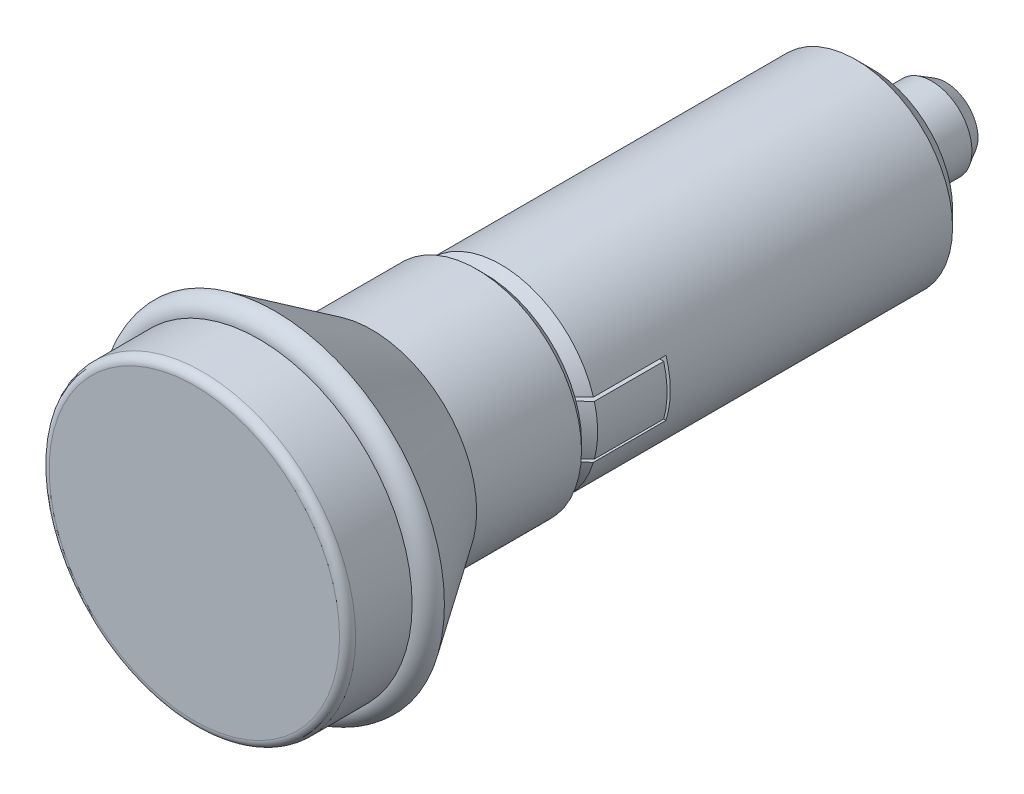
ISO-10303-21;
HEADER;
FILE_DESCRIPTION(('STEP AP214'),'2;1');
FILE_NAME('part.step','',(''),(''),'','','');
FILE_SCHEMA(('AUTOMOTIVE_DESIGN { 1 0 10303 214 1 1 1 1 }'));
ENDSEC;
DATA;
#1=APPLICATION_CONTEXT('core data for automotive mechanical design processes');
#2=APPLICATION_PROTOCOL_DEFINITION('international standard','automotive_design',2000,#1);
#3=PRODUCT_CONTEXT('',#1,'mechanical');
#4=PRODUCT('Part','Part','',(#3));
#5=PRODUCT_RELATED_PRODUCT_CATEGORY('part','',(#4));
#6=PRODUCT_DEFINITION_FORMATION('','',#4);
#7=PRODUCT_DEFINITION_CONTEXT('part definition',#1,'design');
#8=PRODUCT_DEFINITION('design','',#6,#7);
#9=PRODUCT_DEFINITION_SHAPE('','',#8);
#10=(LENGTH_UNIT() NAMED_UNIT(*) SI_UNIT(.MILLI.,.METRE.));
#11=(NAMED_UNIT(*) PLANE_ANGLE_UNIT() SI_UNIT($,.RADIAN.));
#12=(NAMED_UNIT(*) SI_UNIT($,.STERADIAN.) SOLID_ANGLE_UNIT());
#13=UNCERTAINTY_MEASURE_WITH_UNIT(LENGTH_MEASURE(1.E-05),#10,'distance_accuracy_value','');
#14=(GEOMETRIC_REPRESENTATION_CONTEXT(3) GLOBAL_UNCERTAINTY_ASSIGNED_CONTEXT((#13)) GLOBAL_UNIT_ASSIGNED_CONTEXT((#10,
#11,#12)) REPRESENTATION_CONTEXT('',''));
#15=CARTESIAN_POINT('',(0.,0.,0.));
#16=DIRECTION('',(0.,0.,1.));
#17=DIRECTION('',(1.,0.,0.));
#18=AXIS2_PLACEMENT_3D('',#15,#16,#17);
#19=CARTESIAN_POINT('',(0.,0.,24.));
#20=DIRECTION('',(0.,0.,-1.));
#21=DIRECTION('',(-1.,0.,0.));
#22=AXIS2_PLACEMENT_3D('',#19,#20,#21);
#23=CONICAL_SURFACE('',#22,5.,0.785398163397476);
#24=CARTESIAN_POINT('',(0.,0.,23.));
#25=DIRECTION('',(0.,0.,1.));
#26=DIRECTION('',(1.,0.,0.));
#27=AXIS2_PLACEMENT_3D('',#24,#25,#26);
#28=CIRCLE('',#27,6.);
#29=CARTESIAN_POINT('',(-5.7391201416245,-1.75,23.));
#30=VERTEX_POINT('',#29);
#31=CARTESIAN_POINT('',(5.7391201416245,-1.75,23.));
#32=VERTEX_POINT('',#31);
#33=EDGE_CURVE('E274',#30,#32,#28,.T.);
#34=ORIENTED_EDGE('',*,*,#33,.T.);
#35=CARTESIAN_POINT('',(9.98606413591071,-1.75,18.8617567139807));
#36=CARTESIAN_POINT('',(9.79195371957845,-1.75,19.0529513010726));
#37=CARTESIAN_POINT('',(9.59776250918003,-1.75,19.2440639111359));
#38=CARTESIAN_POINT('',(9.20918098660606,-1.75,19.6260870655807));
#39=CARTESIAN_POINT('',(9.01479067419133,-1.75,19.816997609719));
#40=CARTESIAN_POINT('',(8.43125643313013,-1.75,20.3893771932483));
#41=CARTESIAN_POINT('',(8.04175825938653,-1.75,20.7704852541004));
#42=CARTESIAN_POINT('',(7.26146930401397,-1.75,21.5311462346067));
#43=CARTESIAN_POINT('',(6.87067894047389,-1.75,21.91069958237));
#44=CARTESIAN_POINT('',(6.28277565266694,-1.75,22.4782513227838));
#45=CARTESIAN_POINT('',(6.08652149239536,-1.75,22.6671389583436));
#46=CARTESIAN_POINT('',(5.69325388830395,-1.75,23.0441219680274));
#47=CARTESIAN_POINT('',(5.49624044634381,-1.75,23.2322173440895));
#48=CARTESIAN_POINT('',(5.11745439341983,-1.75,23.5918938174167));
#49=CARTESIAN_POINT('',(4.93576230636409,-1.75,23.7635596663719));
#50=CARTESIAN_POINT('',(4.57122487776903,-1.75,24.1056553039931));
#51=CARTESIAN_POINT('',(4.38837956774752,-1.75,24.2760851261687));
#52=CARTESIAN_POINT('',(4.11288351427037,-1.75,24.5304276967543));
#53=CARTESIAN_POINT('',(4.02083980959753,-1.75,24.6149978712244));
#54=CARTESIAN_POINT('',(3.83626386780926,-1.75,24.7836023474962));
#55=CARTESIAN_POINT('',(3.74373163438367,-1.75,24.8676366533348));
#56=CARTESIAN_POINT('',(3.55807044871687,-1.75,25.0350604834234));
#57=CARTESIAN_POINT('',(3.46494144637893,-1.75,25.1184499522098));
#58=CARTESIAN_POINT('',(3.27794997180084,-1.75,25.2844068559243));
#59=CARTESIAN_POINT('',(3.18408748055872,-1.75,25.3669742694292));
#60=CARTESIAN_POINT('',(3.08978838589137,-1.75,25.4490434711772));
#61=B_SPLINE_CURVE_WITH_KNOTS('',3,(#35,#36,#37,#38,#39,#40,#41,#42,#43,#44,#45,#46,#47,#48,#49,
#50,#51,#52,#53,#54,#55,#56,#57,#58,#59,#60),.UNSPECIFIED.,.F.,.F.,(4,2,2,2,2,2,2,2,2,2,2,2,4),
(0.,0.817378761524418,1.63475850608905,3.26955615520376,4.9038684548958,5.72102549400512,
6.53818053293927,7.28806398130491,8.03792702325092,8.41291525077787,8.78790065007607,
9.16291795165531,9.53794500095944),.UNSPECIFIED.);
#62=CARTESIAN_POINT('',(4.68374849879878,-1.75,24.));
#63=VERTEX_POINT('',#62);
#64=EDGE_CURVE('E342',#32,#63,#61,.T.);
#65=ORIENTED_EDGE('',*,*,#64,.T.);
#66=CARTESIAN_POINT('',(0.,0.,24.));
#67=DIRECTION('',(0.,0.,1.));
#68=DIRECTION('',(1.,0.,0.));
#69=AXIS2_PLACEMENT_3D('',#66,#67,#68);
#70=CIRCLE('',#69,5.);
#71=CARTESIAN_POINT('',(-4.68374849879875,-1.75,24.));
#72=VERTEX_POINT('',#71);
#73=EDGE_CURVE('E279',#72,#63,#70,.T.);
#74=ORIENTED_EDGE('',*,*,#73,.F.);
#75=CARTESIAN_POINT('',(-8.80565748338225,-1.75,20.0221325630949));
#76=CARTESIAN_POINT('',(-8.63307273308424,-1.75,20.1914043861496));
#77=CARTESIAN_POINT('',(-8.46039603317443,-1.75,20.3605825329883));
#78=CARTESIAN_POINT('',(-8.11481580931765,-1.75,20.6987076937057));
#79=CARTESIAN_POINT('',(-7.94191228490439,-1.75,20.8676547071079));
#80=CARTESIAN_POINT('',(-7.42278038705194,-1.75,21.3740996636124));
#81=CARTESIAN_POINT('',(-7.07614840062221,-1.75,21.711184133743));
#82=CARTESIAN_POINT('',(-6.3814257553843,-1.75,22.3835541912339));
#83=CARTESIAN_POINT('',(-6.03333577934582,-1.75,22.7188404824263));
#84=CARTESIAN_POINT('',(-5.50924223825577,-1.75,23.2197183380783));
#85=CARTESIAN_POINT('',(-5.33421876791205,-1.75,23.386334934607));
#86=CARTESIAN_POINT('',(-4.98330514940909,-1.75,23.7186524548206));
#87=CARTESIAN_POINT('',(-4.80741500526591,-1.75,23.884353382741));
#88=CARTESIAN_POINT('',(-4.48681217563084,-1.75,24.184255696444));
#89=CARTESIAN_POINT('',(-4.34229353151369,-1.75,24.3186643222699));
#90=CARTESIAN_POINT('',(-4.05224378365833,-1.75,24.5863779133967));
#91=CARTESIAN_POINT('',(-3.90671270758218,-1.75,24.7196829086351));
#92=CARTESIAN_POINT('',(-3.61426973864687,-1.75,24.9848257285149));
#93=CARTESIAN_POINT('',(-3.46735761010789,-1.75,25.1166632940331));
#94=CARTESIAN_POINT('',(-3.24558275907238,-1.75,25.3128433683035));
#95=CARTESIAN_POINT('',(-3.17142007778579,-1.75,25.3779768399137));
#96=CARTESIAN_POINT('',(-3.02253081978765,-1.75,25.5075992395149));
#97=CARTESIAN_POINT('',(-2.94780422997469,-1.75,25.5720881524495));
#98=CARTESIAN_POINT('',(-2.87274886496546,-1.75,25.6361947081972));
#99=B_SPLINE_CURVE_WITH_KNOTS('',3,(#75,#76,#77,#78,#79,#80,#81,#82,#83,#84,#85,#86,#87,#88,#89,
#90,#91,#92,#93,#94,#95,#96,#97,#98),.UNSPECIFIED.,.F.,.F.,(4,2,2,2,2,2,2,2,2,2,2,4),(0.,
0.725221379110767,1.45044425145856,2.90096445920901,4.35086801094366,5.07581314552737,
5.80075492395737,6.39283324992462,6.98489546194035,7.57706061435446,7.87316920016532,
8.16928468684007),.UNSPECIFIED.);
#100=EDGE_CURVE('E413',#30,#72,#99,.T.);
#101=ORIENTED_EDGE('',*,*,#100,.F.);
#102=EDGE_LOOP('',(#34,#65,#74,#101));
#103=FACE_BOUND('',#102,.T.);
#104=ADVANCED_FACE('F14',(#103),#23,.T.);
#105=CARTESIAN_POINT('',(4.75368278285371,-1.55,24.));
#106=VERTEX_POINT('',#105);
#107=CARTESIAN_POINT('',(4.75368278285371,1.55,24.));
#108=VERTEX_POINT('',#107);
#109=EDGE_CURVE('E283',#106,#108,#70,.T.);
#110=ORIENTED_EDGE('',*,*,#109,.F.);
#111=CARTESIAN_POINT('',(2.78896725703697,-1.55,25.8092573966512));
#112=CARTESIAN_POINT('',(2.89768856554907,-1.55,25.7141897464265));
#113=CARTESIAN_POINT('',(3.00579352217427,-1.55,25.618423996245));
#114=CARTESIAN_POINT('',(3.22100554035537,-1.55,25.4257851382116));
#115=CARTESIAN_POINT('',(3.32811264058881,-1.55,25.3289120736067));
#116=CARTESIAN_POINT('',(3.54156099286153,-1.55,25.13435018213));
#117=CARTESIAN_POINT('',(3.64790232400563,-1.55,25.0366614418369));
#118=CARTESIAN_POINT('',(3.85998425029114,-1.55,24.8406320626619));
#119=CARTESIAN_POINT('',(3.96572483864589,-1.55,24.7422914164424));
#120=CARTESIAN_POINT('',(4.28219856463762,-1.55,24.4465341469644));
#121=CARTESIAN_POINT('',(4.49221627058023,-1.55,24.2483523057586));
#122=CARTESIAN_POINT('',(4.91097676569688,-1.55,23.8506356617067));
#123=CARTESIAN_POINT('',(5.11971951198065,-1.55,23.6511008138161));
#124=CARTESIAN_POINT('',(5.71877120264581,-1.55,23.0759166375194));
#125=CARTESIAN_POINT('',(6.10795823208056,-1.55,22.699099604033));
#126=CARTESIAN_POINT('',(6.88456881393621,-1.55,21.9436641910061));
#127=CARTESIAN_POINT('',(7.27199238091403,-1.55,21.5650458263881));
#128=CARTESIAN_POINT('',(8.04582678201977,-1.55,20.8065958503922));
#129=CARTESIAN_POINT('',(8.43223735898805,-1.55,20.4267639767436));
#130=CARTESIAN_POINT('',(9.20429607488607,-1.55,19.6663292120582));
#131=CARTESIAN_POINT('',(9.58994421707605,-1.55,19.2857263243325));
#132=CARTESIAN_POINT('',(9.97538329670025,-1.55,18.9049134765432));
#133=B_SPLINE_CURVE_WITH_KNOTS('',3,(#111,#112,#113,#114,#115,#116,#117,#118,#119,#120,#121,
#122,#123,#124,#125,#126,#127,#128,#129,#130,#131,#132),.UNSPECIFIED.,.F.,.F.,(4,2,2,2,2,2,2,2,
2,2,4),(0.,0.433261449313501,0.866506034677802,1.299705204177,1.73290925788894,2.59918467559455,
3.46548907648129,5.09062781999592,6.71575312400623,8.34125730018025,9.96675451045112),.UNSPECIFIED.);
#134=CARTESIAN_POINT('',(5.79633504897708,-1.55,23.));
#135=VERTEX_POINT('',#134);
#136=EDGE_CURVE('E335',#106,#135,#133,.T.);
#137=ORIENTED_EDGE('',*,*,#136,.T.);
#138=CARTESIAN_POINT('',(5.79633504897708,1.55,23.));
#139=VERTEX_POINT('',#138);
#140=EDGE_CURVE('E278',#135,#139,#28,.T.);
#141=ORIENTED_EDGE('',*,*,#140,.T.);
#142=CARTESIAN_POINT('',(9.97538329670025,1.55,18.9049134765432));
#143=CARTESIAN_POINT('',(9.58994421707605,1.55,19.2857263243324));
#144=CARTESIAN_POINT('',(9.20429607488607,1.55,19.6663292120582));
#145=CARTESIAN_POINT('',(8.43223735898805,1.55,20.4267639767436));
#146=CARTESIAN_POINT('',(8.04582678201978,1.55,20.8065958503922));
#147=CARTESIAN_POINT('',(7.27199238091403,1.55,21.5650458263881));
#148=CARTESIAN_POINT('',(6.88456881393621,1.55,21.9436641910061));
#149=CARTESIAN_POINT('',(6.10795823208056,1.55,22.699099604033));
#150=CARTESIAN_POINT('',(5.71877120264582,1.55,23.0759166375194));
#151=CARTESIAN_POINT('',(5.11971951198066,1.55,23.6511008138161));
#152=CARTESIAN_POINT('',(4.91097676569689,1.55,23.8506356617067));
#153=CARTESIAN_POINT('',(4.49221627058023,1.55,24.2483523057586));
#154=CARTESIAN_POINT('',(4.28219856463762,1.55,24.4465341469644));
#155=CARTESIAN_POINT('',(3.96572483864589,1.55,24.7422914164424));
#156=CARTESIAN_POINT('',(3.85998425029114,1.55,24.8406320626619));
#157=CARTESIAN_POINT('',(3.64790232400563,1.55,25.0366614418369));
#158=CARTESIAN_POINT('',(3.54156099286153,1.55,25.13435018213));
#159=CARTESIAN_POINT('',(3.32811264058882,1.55,25.3289120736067));
#160=CARTESIAN_POINT('',(3.22100554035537,1.55,25.4257851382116));
#161=CARTESIAN_POINT('',(3.00579352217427,1.55,25.618423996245));
#162=CARTESIAN_POINT('',(2.89768856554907,1.55,25.7141897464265));
#163=CARTESIAN_POINT('',(2.78896725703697,1.55,25.8092573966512));
#164=B_SPLINE_CURVE_WITH_KNOTS('',3,(#142,#143,#144,#145,#146,#147,#148,#149,#150,#151,#152,
#153,#154,#155,#156,#157,#158,#159,#160,#161,#162,#163),.UNSPECIFIED.,.F.,.F.,(4,2,2,2,2,2,2,2,
2,2,4),(0.,1.62549721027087,3.25100138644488,4.87612669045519,6.50126543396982,7.36756983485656,
8.23384525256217,8.66704930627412,9.10024847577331,9.53349306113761,9.96675451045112),.UNSPECIFIED.);
#165=EDGE_CURVE('E209',#139,#108,#164,.T.);
#166=ORIENTED_EDGE('',*,*,#165,.T.);
#167=EDGE_LOOP('',(#110,#137,#141,#166));
#168=FACE_BOUND('',#167,.T.);
#169=ADVANCED_FACE('F339',(#168),#23,.T.);
#170=CARTESIAN_POINT('',(4.68374849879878,1.75,24.));
#171=VERTEX_POINT('',#170);
#172=CARTESIAN_POINT('',(-4.68374849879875,1.75,24.));
#173=VERTEX_POINT('',#172);
#174=EDGE_CURVE('E284',#171,#173,#70,.T.);
#175=ORIENTED_EDGE('',*,*,#174,.F.);
#176=CARTESIAN_POINT('',(3.08978838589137,1.75,25.4490434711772));
#177=CARTESIAN_POINT('',(3.18408748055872,1.75,25.3669742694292));
#178=CARTESIAN_POINT('',(3.27794997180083,1.75,25.2844068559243));
#179=CARTESIAN_POINT('',(3.46494144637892,1.75,25.1184499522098));
#180=CARTESIAN_POINT('',(3.55807044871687,1.75,25.0350604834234));
#181=CARTESIAN_POINT('',(3.74373163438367,1.75,24.8676366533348));
#182=CARTESIAN_POINT('',(3.83626386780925,1.75,24.7836023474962));
#183=CARTESIAN_POINT('',(4.02083980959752,1.75,24.6149978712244));
#184=CARTESIAN_POINT('',(4.11288351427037,1.75,24.5304276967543));
#185=CARTESIAN_POINT('',(4.38837956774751,1.75,24.2760851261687));
#186=CARTESIAN_POINT('',(4.57122487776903,1.75,24.1056553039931));
#187=CARTESIAN_POINT('',(4.93576230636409,1.75,23.7635596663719));
#188=CARTESIAN_POINT('',(5.11745439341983,1.75,23.5918938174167));
#189=CARTESIAN_POINT('',(5.49624044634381,1.75,23.2322173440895));
#190=CARTESIAN_POINT('',(5.69325388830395,1.75,23.0441219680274));
#191=CARTESIAN_POINT('',(6.08652149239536,1.75,22.6671389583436));
#192=CARTESIAN_POINT('',(6.28277565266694,1.75,22.4782513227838));
#193=CARTESIAN_POINT('',(6.87067894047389,1.75,21.91069958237));
#194=CARTESIAN_POINT('',(7.26146930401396,1.75,21.5311462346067));
#195=CARTESIAN_POINT('',(8.04175825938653,1.75,20.7704852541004));
#196=CARTESIAN_POINT('',(8.43125643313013,1.75,20.3893771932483));
#197=CARTESIAN_POINT('',(9.01479067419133,1.75,19.816997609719));
#198=CARTESIAN_POINT('',(9.20918098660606,1.75,19.6260870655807));
#199=CARTESIAN_POINT('',(9.59776250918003,1.75,19.2440639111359));
#200=CARTESIAN_POINT('',(9.79195371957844,1.75,19.0529513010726));
#201=CARTESIAN_POINT('',(9.98606413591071,1.75,18.8617567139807));
#202=B_SPLINE_CURVE_WITH_KNOTS('',3,(#176,#177,#178,#179,#180,#181,#182,#183,#184,#185,#186,
#187,#188,#189,#190,#191,#192,#193,#194,#195,#196,#197,#198,#199,#200,#201),.UNSPECIFIED.,.F.,
.F.,(4,2,2,2,2,2,2,2,2,2,2,2,4),(0.,0.375027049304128,0.750044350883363,1.12502975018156,
1.50001797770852,2.24988101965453,2.99976446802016,3.81691950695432,4.63407654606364,
6.26838884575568,7.90318649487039,8.72056623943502,9.53794500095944),.UNSPECIFIED.);
#203=CARTESIAN_POINT('',(5.7391201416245,1.75,23.));
#204=VERTEX_POINT('',#203);
#205=EDGE_CURVE('E186',#171,#204,#202,.T.);
#206=ORIENTED_EDGE('',*,*,#205,.T.);
#207=CARTESIAN_POINT('',(-5.7391201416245,1.75,23.));
#208=VERTEX_POINT('',#207);
#209=EDGE_CURVE('E273',#204,#208,#28,.T.);
#210=ORIENTED_EDGE('',*,*,#209,.T.);
#211=CARTESIAN_POINT('',(-2.87274886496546,1.75,25.6361947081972));
#212=CARTESIAN_POINT('',(-2.94780422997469,1.75,25.5720881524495));
#213=CARTESIAN_POINT('',(-3.02253081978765,1.75,25.5075992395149));
#214=CARTESIAN_POINT('',(-3.17142007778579,1.75,25.3779768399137));
#215=CARTESIAN_POINT('',(-3.24558275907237,1.75,25.3128433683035));
#216=CARTESIAN_POINT('',(-3.46735761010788,1.75,25.1166632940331));
#217=CARTESIAN_POINT('',(-3.61426973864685,1.75,24.9848257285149));
#218=CARTESIAN_POINT('',(-3.90671270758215,1.75,24.7196829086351));
#219=CARTESIAN_POINT('',(-4.0522437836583,1.75,24.5863779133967));
#220=CARTESIAN_POINT('',(-4.34229353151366,1.75,24.31866432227));
#221=CARTESIAN_POINT('',(-4.48681217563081,1.75,24.1842556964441));
#222=CARTESIAN_POINT('',(-4.80741500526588,1.75,23.8843533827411));
#223=CARTESIAN_POINT('',(-4.98330514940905,1.75,23.7186524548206));
#224=CARTESIAN_POINT('',(-5.33421876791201,1.75,23.386334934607));
#225=CARTESIAN_POINT('',(-5.50924223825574,1.75,23.2197183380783));
#226=CARTESIAN_POINT('',(-6.0333357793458,1.75,22.7188404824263));
#227=CARTESIAN_POINT('',(-6.38142575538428,1.75,22.3835541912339));
#228=CARTESIAN_POINT('',(-7.07614840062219,1.75,21.711184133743));
#229=CARTESIAN_POINT('',(-7.42278038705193,1.75,21.3740996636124));
#230=CARTESIAN_POINT('',(-7.94191228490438,1.75,20.8676547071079));
#231=CARTESIAN_POINT('',(-8.11481580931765,1.75,20.6987076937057));
#232=CARTESIAN_POINT('',(-8.46039603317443,1.75,20.3605825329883));
#233=CARTESIAN_POINT('',(-8.63307273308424,1.75,20.1914043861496));
#234=CARTESIAN_POINT('',(-8.80565748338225,1.75,20.0221325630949));
#235=B_SPLINE_CURVE_WITH_KNOTS('',3,(#211,#212,#213,#214,#215,#216,#217,#218,#219,#220,#221,
#222,#223,#224,#225,#226,#227,#228,#229,#230,#231,#232,#233,#234),.UNSPECIFIED.,.F.,.F.,(4,2,2,
2,2,2,2,2,2,2,2,4),(0.,0.296115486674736,0.592224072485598,1.18438922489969,1.7764514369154,
2.36852976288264,3.09347154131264,3.81841667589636,5.26832022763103,6.71884043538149,
7.44406330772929,8.16928468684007),.UNSPECIFIED.);
#236=EDGE_CURVE('E244',#173,#208,#235,.T.);
#237=ORIENTED_EDGE('',*,*,#236,.F.);
#238=EDGE_LOOP('',(#175,#206,#210,#237));
#239=FACE_BOUND('',#238,.T.);
#240=ADVANCED_FACE('F374',(#239),#23,.T.);
#241=CARTESIAN_POINT('',(0.,0.,41.9999999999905));
#242=DIRECTION('',(0.,0.,1.));
#243=DIRECTION('',(1.,0.,0.));
#244=AXIS2_PLACEMENT_3D('',#241,#242,#243);
#245=CYLINDRICAL_SURFACE('',#244,6.);
#246=CARTESIAN_POINT('',(0.,0.,1.));
#247=DIRECTION('',(0.,0.,1.));
#248=DIRECTION('',(1.,0.,0.));
#249=AXIS2_PLACEMENT_3D('',#246,#247,#248);
#250=CIRCLE('',#249,6.);
#251=CARTESIAN_POINT('',(6.,0.,1.));
#252=VERTEX_POINT('',#251);
#253=EDGE_CURVE('E270',#252,#252,#250,.T.);
#254=ORIENTED_EDGE('',*,*,#253,.T.);
#255=EDGE_LOOP('',(#254));
#256=FACE_BOUND('',#255,.T.);
#257=CARTESIAN_POINT('',(0.,0.,18.5));
#258=DIRECTION('',(0.,0.,1.));
#259=DIRECTION('',(1.,0.,0.));
#260=AXIS2_PLACEMENT_3D('',#257,#258,#259);
#261=CIRCLE('',#260,6.);
#262=CARTESIAN_POINT('',(5.7391201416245,1.75,18.5));
#263=VERTEX_POINT('',#262);
#264=CARTESIAN_POINT('',(5.7391201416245,-1.75,18.5));
#265=VERTEX_POINT('',#264);
#266=EDGE_CURVE('E166',#263,#265,#261,.F.);
#267=ORIENTED_EDGE('',*,*,#266,.T.);
#268=DIRECTION('',(0.,0.,1.));
#269=VECTOR('',#268,1.);
#270=CARTESIAN_POINT('',(5.7391201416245,-1.75,41.9999999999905));
#271=LINE('',#270,#269);
#272=EDGE_CURVE('E9',#265,#32,#271,.T.);
#273=ORIENTED_EDGE('',*,*,#272,.T.);
#274=ORIENTED_EDGE('',*,*,#33,.F.);
#275=DIRECTION('',(0.,0.,1.));
#276=VECTOR('',#275,1.);
#277=CARTESIAN_POINT('',(-5.7391201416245,-1.75,41.9999999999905));
#278=LINE('',#277,#276);
#279=CARTESIAN_POINT('',(-5.7391201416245,-1.75,18.5));
#280=VERTEX_POINT('',#279);
#281=EDGE_CURVE('E313',#280,#30,#278,.T.);
#282=ORIENTED_EDGE('',*,*,#281,.F.);
#283=CARTESIAN_POINT('',(0.,0.,18.5));
#284=DIRECTION('',(0.,0.,-1.));
#285=DIRECTION('',(-1.,0.,0.));
#286=AXIS2_PLACEMENT_3D('',#283,#284,#285);
#287=CIRCLE('',#286,6.);
#288=CARTESIAN_POINT('',(-5.7391201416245,1.75,18.5));
#289=VERTEX_POINT('',#288);
#290=EDGE_CURVE('E37',#289,#280,#287,.F.);
#291=ORIENTED_EDGE('',*,*,#290,.F.);
#292=DIRECTION('',(0.,0.,1.));
#293=VECTOR('',#292,1.);
#294=CARTESIAN_POINT('',(-5.7391201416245,1.75,41.9999999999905));
#295=LINE('',#294,#293);
#296=EDGE_CURVE('E311',#208,#289,#295,.F.);
#297=ORIENTED_EDGE('',*,*,#296,.F.);
#298=ORIENTED_EDGE('',*,*,#209,.F.);
#299=DIRECTION('',(0.,0.,1.));
#300=VECTOR('',#299,1.);
#301=CARTESIAN_POINT('',(5.7391201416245,1.75,41.9999999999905));
#302=LINE('',#301,#300);
#303=EDGE_CURVE('E322',#204,#263,#302,.F.);
#304=ORIENTED_EDGE('',*,*,#303,.T.);
#305=EDGE_LOOP('',(#267,#273,#274,#282,#291,#297,#298,#304));
#306=FACE_BOUND('',#305,.T.);
#307=ADVANCED_FACE('F390',(#256,#306),#245,.T.);
#308=ORIENTED_EDGE('',*,*,#140,.F.);
#309=DIRECTION('',(0.,0.,1.));
#310=VECTOR('',#309,1.);
#311=CARTESIAN_POINT('',(5.79633504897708,-1.55,41.9999999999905));
#312=LINE('',#311,#310);
#313=CARTESIAN_POINT('',(5.79633504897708,-1.55,18.7));
#314=VERTEX_POINT('',#313);
#315=EDGE_CURVE('E22',#135,#314,#312,.F.);
#316=ORIENTED_EDGE('',*,*,#315,.T.);
#317=CARTESIAN_POINT('',(0.,0.,18.7));
#318=DIRECTION('',(0.,0.,-1.));
#319=DIRECTION('',(-1.,0.,0.));
#320=AXIS2_PLACEMENT_3D('',#317,#318,#319);
#321=CIRCLE('',#320,6.);
#322=CARTESIAN_POINT('',(5.79633504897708,1.55,18.7));
#323=VERTEX_POINT('',#322);
#324=EDGE_CURVE('E318',#314,#323,#321,.F.);
#325=ORIENTED_EDGE('',*,*,#324,.T.);
#326=DIRECTION('',(0.,0.,1.));
#327=VECTOR('',#326,1.);
#328=CARTESIAN_POINT('',(5.79633504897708,1.55,41.9999999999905));
#329=LINE('',#328,#327);
#330=EDGE_CURVE('E324',#323,#139,#329,.T.);
#331=ORIENTED_EDGE('',*,*,#330,.T.);
#332=EDGE_LOOP('',(#308,#316,#325,#331));
#333=FACE_BOUND('',#332,.T.);
#334=ADVANCED_FACE('F329',(#333),#245,.T.);
#335=CARTESIAN_POINT('',(0.,0.,18.7));
#336=DIRECTION('',(0.,0.,1.));
#337=DIRECTION('',(1.,0.,0.));
#338=AXIS2_PLACEMENT_3D('',#335,#336,#337);
#339=CIRCLE('',#338,6.);
#340=CARTESIAN_POINT('',(-5.79633504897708,-1.55,18.7));
#341=VERTEX_POINT('',#340);
#342=CARTESIAN_POINT('',(-5.79633504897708,1.55,18.7));
#343=VERTEX_POINT('',#342);
#344=EDGE_CURVE('E306',#341,#343,#339,.F.);
#345=ORIENTED_EDGE('',*,*,#344,.F.);
#346=DIRECTION('',(0.,0.,1.));
#347=VECTOR('',#346,1.);
#348=CARTESIAN_POINT('',(-5.79633504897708,-1.55,41.9999999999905));
#349=LINE('',#348,#347);
#350=CARTESIAN_POINT('',(-5.79633504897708,-1.55,23.));
#351=VERTEX_POINT('',#350);
#352=EDGE_CURVE('E315',#351,#341,#349,.F.);
#353=ORIENTED_EDGE('',*,*,#352,.F.);
#354=CARTESIAN_POINT('',(-5.79633504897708,1.55,23.));
#355=VERTEX_POINT('',#354);
#356=EDGE_CURVE('E277',#355,#351,#28,.T.);
#357=ORIENTED_EDGE('',*,*,#356,.F.);
#358=DIRECTION('',(0.,0.,1.));
#359=VECTOR('',#358,1.);
#360=CARTESIAN_POINT('',(-5.79633504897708,1.55,41.9999999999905));
#361=LINE('',#360,#359);
#362=EDGE_CURVE('E308',#343,#355,#361,.T.);
#363=ORIENTED_EDGE('',*,*,#362,.F.);
#364=EDGE_LOOP('',(#345,#353,#357,#363));
#365=FACE_BOUND('',#364,.T.);
#366=ADVANCED_FACE('F396',(#365),#245,.T.);
#367=CARTESIAN_POINT('',(0.,0.,0.));
#368=DIRECTION('',(0.,0.,1.));
#369=DIRECTION('',(0.,1.,0.));
#370=AXIS2_PLACEMENT_3D('',#367,#368,#369);
#371=SPHERICAL_SURFACE('',#370,4.99999999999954);
#372=CARTESIAN_POINT('',(0.,0.,-4.58812253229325));
#373=DIRECTION('',(0.,0.,1.));
#374=DIRECTION('',(1.,0.,0.));
#375=AXIS2_PLACEMENT_3D('',#372,#373,#374);
#376=CIRCLE('',#375,1.98724221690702);
#377=CARTESIAN_POINT('',(1.98724221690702,0.,-4.58812253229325));
#378=VERTEX_POINT('',#377);
#379=EDGE_CURVE('E252',#378,#378,#376,.T.);
#380=ORIENTED_EDGE('',*,*,#379,.F.);
#381=EDGE_LOOP('',(#380));
#382=FACE_BOUND('',#381,.T.);
#383=ADVANCED_FACE('F16',(#382),#371,.T.);
#384=CARTESIAN_POINT('',(0.,9.00000426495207,41.9999999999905));
#385=DIRECTION('',(0.,0.,1.));
#386=DIRECTION('',(1.,0.,0.));
#387=AXIS2_PLACEMENT_3D('',#384,#385,#386);
#388=PLANE('',#387);
#389=CARTESIAN_POINT('',(0.,0.,41.9999999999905));
#390=DIRECTION('',(0.,0.,1.));
#391=DIRECTION('',(1.,0.,0.));
#392=AXIS2_PLACEMENT_3D('',#389,#390,#391);
#393=CIRCLE('',#392,9.00000426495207);
#394=CARTESIAN_POINT('',(9.00000426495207,0.,41.9999999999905));
#395=VERTEX_POINT('',#394);
#396=EDGE_CURVE('E303',#395,#395,#393,.T.);
#397=ORIENTED_EDGE('',*,*,#396,.T.);
#398=EDGE_LOOP('',(#397));
#399=FACE_BOUND('',#398,.T.);
#400=ADVANCED_FACE('F617',(#399),#388,.T.);
#401=CARTESIAN_POINT('',(0.,0.,41.5));
#402=DIRECTION('',(0.,0.,1.));
#403=DIRECTION('',(1.,0.,0.));
#404=AXIS2_PLACEMENT_3D('',#401,#402,#403);
#405=TOROIDAL_SURFACE('',#404,8.99999999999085,0.500000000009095);
#406=CARTESIAN_POINT('',(0.,0.,41.4999999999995));
#407=DIRECTION('',(0.,0.,1.));
#408=DIRECTION('',(1.,0.,0.));
#409=AXIS2_PLACEMENT_3D('',#406,#407,#408);
#410=CIRCLE('',#409,9.5);
#411=CARTESIAN_POINT('',(9.5,0.,41.4999999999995));
#412=VERTEX_POINT('',#411);
#413=EDGE_CURVE('E300',#412,#412,#410,.T.);
#414=ORIENTED_EDGE('',*,*,#413,.T.);
#415=EDGE_LOOP('',(#414));
#416=FACE_BOUND('',#415,.T.);
#417=ORIENTED_EDGE('',*,*,#396,.F.);
#418=EDGE_LOOP('',(#417));
#419=FACE_BOUND('',#418,.T.);
#420=ADVANCED_FACE('F608',(#416,#419),#405,.T.);
#421=CARTESIAN_POINT('',(0.,0.,41.9999999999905));
#422=DIRECTION('',(0.,0.,1.));
#423=DIRECTION('',(1.,0.,0.));
#424=AXIS2_PLACEMENT_3D('',#421,#422,#423);
#425=CYLINDRICAL_SURFACE('',#424,9.5);
#426=CARTESIAN_POINT('',(0.,0.,37.9999999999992));
#427=DIRECTION('',(0.,0.,1.));
#428=DIRECTION('',(1.,0.,0.));
#429=AXIS2_PLACEMENT_3D('',#426,#427,#428);
#430=CIRCLE('',#429,9.5);
#431=CARTESIAN_POINT('',(9.5,0.,37.9999999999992));
#432=VERTEX_POINT('',#431);
#433=EDGE_CURVE('E297',#432,#432,#430,.T.);
#434=ORIENTED_EDGE('',*,*,#433,.T.);
#435=EDGE_LOOP('',(#434));
#436=FACE_BOUND('',#435,.T.);
#437=ORIENTED_EDGE('',*,*,#413,.F.);
#438=EDGE_LOOP('',(#437));
#439=FACE_BOUND('',#438,.T.);
#440=ADVANCED_FACE('F599',(#436,#439),#425,.T.);
#441=CARTESIAN_POINT('',(0.,0.,37.000000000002));
#442=DIRECTION('',(0.,0.,1.));
#443=DIRECTION('',(1.,0.,0.));
#444=AXIS2_PLACEMENT_3D('',#441,#442,#443);
#445=TOROIDAL_SURFACE('',#444,9.49999999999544,0.999999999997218);
#446=CARTESIAN_POINT('',(0.,0.,37.));
#447=DIRECTION('',(0.,0.,1.));
#448=DIRECTION('',(1.,0.,0.));
#449=AXIS2_PLACEMENT_3D('',#446,#447,#448);
#450=CIRCLE('',#449,10.4999999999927);
#451=CARTESIAN_POINT('',(10.4999999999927,0.,37.));
#452=VERTEX_POINT('',#451);
#453=EDGE_CURVE('E294',#452,#452,#450,.T.);
#454=ORIENTED_EDGE('',*,*,#453,.T.);
#455=EDGE_LOOP('',(#454));
#456=FACE_BOUND('',#455,.T.);
#457=ORIENTED_EDGE('',*,*,#433,.F.);
#458=EDGE_LOOP('',(#457));
#459=FACE_BOUND('',#458,.T.);
#460=ADVANCED_FACE('F590',(#456,#459),#445,.T.);
#461=CARTESIAN_POINT('',(0.,0.,37.));
#462=DIRECTION('',(0.,0.,1.));
#463=DIRECTION('',(1.,0.,0.));
#464=AXIS2_PLACEMENT_3D('',#461,#462,#463);
#465=CONICAL_SURFACE('',#464,10.4999999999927,0.588002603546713);
#466=CARTESIAN_POINT('',(0.,0.,31.));
#467=DIRECTION('',(0.,0.,1.));
#468=DIRECTION('',(1.,0.,0.));
#469=AXIS2_PLACEMENT_3D('',#466,#467,#468);
#470=CIRCLE('',#469,6.5);
#471=CARTESIAN_POINT('',(6.5,0.,31.));
#472=VERTEX_POINT('',#471);
#473=EDGE_CURVE('E291',#472,#472,#470,.T.);
#474=ORIENTED_EDGE('',*,*,#473,.T.);
#475=EDGE_LOOP('',(#474));
#476=FACE_BOUND('',#475,.T.);
#477=ORIENTED_EDGE('',*,*,#453,.F.);
#478=EDGE_LOOP('',(#477));
#479=FACE_BOUND('',#478,.T.);
#480=ADVANCED_FACE('F581',(#476,#479),#465,.T.);
#481=CARTESIAN_POINT('',(0.,0.,41.9999999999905));
#482=DIRECTION('',(0.,0.,1.));
#483=DIRECTION('',(1.,0.,0.));
#484=AXIS2_PLACEMENT_3D('',#481,#482,#483);
#485=CYLINDRICAL_SURFACE('',#484,6.5);
#486=CARTESIAN_POINT('',(0.,0.,24.5));
#487=DIRECTION('',(0.,0.,1.));
#488=DIRECTION('',(1.,0.,0.));
#489=AXIS2_PLACEMENT_3D('',#486,#487,#488);
#490=CIRCLE('',#489,6.5);
#491=CARTESIAN_POINT('',(6.5,0.,24.5));
#492=VERTEX_POINT('',#491);
#493=EDGE_CURVE('E288',#492,#492,#490,.T.);
#494=ORIENTED_EDGE('',*,*,#493,.T.);
#495=EDGE_LOOP('',(#494));
#496=FACE_BOUND('',#495,.T.);
#497=ORIENTED_EDGE('',*,*,#473,.F.);
#498=EDGE_LOOP('',(#497));
#499=FACE_BOUND('',#498,.T.);
#500=ADVANCED_FACE('F571',(#496,#499),#485,.T.);
#501=CARTESIAN_POINT('',(0.,0.,24.5));
#502=DIRECTION('',(0.,0.,1.));
#503=DIRECTION('',(1.,0.,0.));
#504=AXIS2_PLACEMENT_3D('',#501,#502,#503);
#505=CONICAL_SURFACE('',#504,6.5,0.785398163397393);
#506=CARTESIAN_POINT('',(0.,0.,24.));
#507=DIRECTION('',(0.,0.,1.));
#508=DIRECTION('',(1.,0.,0.));
#509=AXIS2_PLACEMENT_3D('',#506,#507,#508);
#510=CIRCLE('',#509,6.);
#511=CARTESIAN_POINT('',(6.,0.,24.));
#512=VERTEX_POINT('',#511);
#513=EDGE_CURVE('E285',#512,#512,#510,.T.);
#514=ORIENTED_EDGE('',*,*,#513,.T.);
#515=EDGE_LOOP('',(#514));
#516=FACE_BOUND('',#515,.T.);
#517=ORIENTED_EDGE('',*,*,#493,.F.);
#518=EDGE_LOOP('',(#517));
#519=FACE_BOUND('',#518,.T.);
#520=ADVANCED_FACE('F386',(#516,#519),#505,.T.);
#521=CARTESIAN_POINT('',(0.,6.,24.));
#522=DIRECTION('',(0.,0.,-1.));
#523=DIRECTION('',(-1.,0.,0.));
#524=AXIS2_PLACEMENT_3D('',#521,#522,#523);
#525=PLANE('',#524);
#526=ORIENTED_EDGE('',*,*,#513,.F.);
#527=EDGE_LOOP('',(#526));
#528=FACE_BOUND('',#527,.T.);
#529=ORIENTED_EDGE('',*,*,#73,.T.);
#530=DIRECTION('',(1.,0.,0.));
#531=VECTOR('',#530,1.);
#532=CARTESIAN_POINT('',(1.,-1.75,24.));
#533=LINE('',#532,#531);
#534=CARTESIAN_POINT('',(1.,-1.75,24.));
#535=VERTEX_POINT('',#534);
#536=EDGE_CURVE('E187',#535,#63,#533,.T.);
#537=ORIENTED_EDGE('',*,*,#536,.F.);
#538=DIRECTION('',(0.,1.,0.));
#539=VECTOR('',#538,1.);
#540=CARTESIAN_POINT('',(1.,-1.75,24.));
#541=LINE('',#540,#539);
#542=CARTESIAN_POINT('',(1.,-1.55,24.));
#543=VERTEX_POINT('',#542);
#544=EDGE_CURVE('E181',#535,#543,#541,.T.);
#545=ORIENTED_EDGE('',*,*,#544,.T.);
#546=DIRECTION('',(1.,0.,0.));
#547=VECTOR('',#546,1.);
#548=CARTESIAN_POINT('',(1.,-1.55,24.));
#549=LINE('',#548,#547);
#550=EDGE_CURVE('E189',#543,#106,#549,.T.);
#551=ORIENTED_EDGE('',*,*,#550,.T.);
#552=ORIENTED_EDGE('',*,*,#109,.T.);
#553=DIRECTION('',(1.,0.,0.));
#554=VECTOR('',#553,1.);
#555=CARTESIAN_POINT('',(1.,1.55,24.));
#556=LINE('',#555,#554);
#557=CARTESIAN_POINT('',(1.,1.55,24.));
#558=VERTEX_POINT('',#557);
#559=EDGE_CURVE('E198',#558,#108,#556,.T.);
#560=ORIENTED_EDGE('',*,*,#559,.F.);
#561=DIRECTION('',(0.,1.,0.));
#562=VECTOR('',#561,1.);
#563=CARTESIAN_POINT('',(1.,1.75,24.));
#564=LINE('',#563,#562);
#565=CARTESIAN_POINT('',(1.,1.75,24.));
#566=VERTEX_POINT('',#565);
#567=EDGE_CURVE('E158',#558,#566,#564,.T.);
#568=ORIENTED_EDGE('',*,*,#567,.T.);
#569=DIRECTION('',(1.,0.,0.));
#570=VECTOR('',#569,1.);
#571=CARTESIAN_POINT('',(1.,1.75,24.));
#572=LINE('',#571,#570);
#573=EDGE_CURVE('E154',#566,#171,#572,.T.);
#574=ORIENTED_EDGE('',*,*,#573,.T.);
#575=ORIENTED_EDGE('',*,*,#174,.T.);
#576=DIRECTION('',(-1.,0.,0.));
#577=VECTOR('',#576,1.);
#578=CARTESIAN_POINT('',(-1.,1.75,24.));
#579=LINE('',#578,#577);
#580=CARTESIAN_POINT('',(-1.,1.75,24.));
#581=VERTEX_POINT('',#580);
#582=EDGE_CURVE('E408',#581,#173,#579,.T.);
#583=ORIENTED_EDGE('',*,*,#582,.F.);
#584=DIRECTION('',(0.,1.,0.));
#585=VECTOR('',#584,1.);
#586=CARTESIAN_POINT('',(-1.,1.75,24.));
#587=LINE('',#586,#585);
#588=CARTESIAN_POINT('',(-1.,1.55,24.));
#589=VERTEX_POINT('',#588);
#590=EDGE_CURVE('E719',#589,#581,#587,.T.);
#591=ORIENTED_EDGE('',*,*,#590,.F.);
#592=DIRECTION('',(-1.,0.,0.));
#593=VECTOR('',#592,1.);
#594=CARTESIAN_POINT('',(-1.,1.55,24.));
#595=LINE('',#594,#593);
#596=CARTESIAN_POINT('',(-4.75368278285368,1.55,24.));
#597=VERTEX_POINT('',#596);
#598=EDGE_CURVE('E711',#589,#597,#595,.T.);
#599=ORIENTED_EDGE('',*,*,#598,.T.);
#600=CARTESIAN_POINT('',(-4.75368278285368,-1.55,24.));
#601=VERTEX_POINT('',#600);
#602=EDGE_CURVE('E282',#597,#601,#70,.T.);
#603=ORIENTED_EDGE('',*,*,#602,.T.);
#604=DIRECTION('',(-1.,0.,0.));
#605=VECTOR('',#604,1.);
#606=CARTESIAN_POINT('',(-1.,-1.55,24.));
#607=LINE('',#606,#605);
#608=CARTESIAN_POINT('',(-1.,-1.55,24.));
#609=VERTEX_POINT('',#608);
#610=EDGE_CURVE('E709',#609,#601,#607,.T.);
#611=ORIENTED_EDGE('',*,*,#610,.F.);
#612=DIRECTION('',(0.,1.,0.));
#613=VECTOR('',#612,1.);
#614=CARTESIAN_POINT('',(-1.,-1.75,24.));
#615=LINE('',#614,#613);
#616=CARTESIAN_POINT('',(-1.,-1.75,24.));
#617=VERTEX_POINT('',#616);
#618=EDGE_CURVE('E736',#617,#609,#615,.T.);
#619=ORIENTED_EDGE('',*,*,#618,.F.);
#620=DIRECTION('',(-1.,0.,0.));
#621=VECTOR('',#620,1.);
#622=CARTESIAN_POINT('',(-1.,-1.75,24.));
#623=LINE('',#622,#621);
#624=EDGE_CURVE('E713',#617,#72,#623,.T.);
#625=ORIENTED_EDGE('',*,*,#624,.T.);
#626=EDGE_LOOP('',(#529,#537,#545,#551,#552,#560,#568,#574,#575,#583,#591,#599,#603,#611,#619,#625));
#627=FACE_BOUND('',#626,.T.);
#628=ADVANCED_FACE('F377',(#528,#627),#525,.T.);
#629=CARTESIAN_POINT('',(-9.97538329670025,1.55,18.9049134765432));
#630=CARTESIAN_POINT('',(-9.58994421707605,1.55,19.2857263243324));
#631=CARTESIAN_POINT('',(-9.20429607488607,1.55,19.6663292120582));
#632=CARTESIAN_POINT('',(-8.43223735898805,1.55,20.4267639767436));
#633=CARTESIAN_POINT('',(-8.04582678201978,1.55,20.8065958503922));
#634=CARTESIAN_POINT('',(-7.27199238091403,1.55,21.5650458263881));
#635=CARTESIAN_POINT('',(-6.88456881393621,1.55,21.9436641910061));
#636=CARTESIAN_POINT('',(-6.10795823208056,1.55,22.699099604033));
#637=CARTESIAN_POINT('',(-5.71877120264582,1.55,23.0759166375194));
#638=CARTESIAN_POINT('',(-5.11971951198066,1.55,23.6511008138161));
#639=CARTESIAN_POINT('',(-4.91097676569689,1.55,23.8506356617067));
#640=CARTESIAN_POINT('',(-4.49221627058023,1.55,24.2483523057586));
#641=CARTESIAN_POINT('',(-4.28219856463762,1.55,24.4465341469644));
#642=CARTESIAN_POINT('',(-3.96572483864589,1.55,24.7422914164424));
#643=CARTESIAN_POINT('',(-3.85998425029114,1.55,24.8406320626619));
#644=CARTESIAN_POINT('',(-3.64790232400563,1.55,25.0366614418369));
#645=CARTESIAN_POINT('',(-3.54156099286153,1.55,25.13435018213));
#646=CARTESIAN_POINT('',(-3.32811264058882,1.55,25.3289120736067));
#647=CARTESIAN_POINT('',(-3.22100554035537,1.55,25.4257851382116));
#648=CARTESIAN_POINT('',(-3.00579352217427,1.55,25.618423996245));
#649=CARTESIAN_POINT('',(-2.89768856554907,1.55,25.7141897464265));
#650=CARTESIAN_POINT('',(-2.78896725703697,1.55,25.8092573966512));
#651=B_SPLINE_CURVE_WITH_KNOTS('',3,(#629,#630,#631,#632,#633,#634,#635,#636,#637,#638,#639,
#640,#641,#642,#643,#644,#645,#646,#647,#648,#649,#650),.UNSPECIFIED.,.F.,.F.,(4,2,2,2,2,2,2,2,
2,2,4),(0.,1.62549721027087,3.25100138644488,4.87612669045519,6.50126543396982,7.36756983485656,
8.23384525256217,8.66704930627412,9.10024847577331,9.53349306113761,9.96675451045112),.UNSPECIFIED.);
#652=EDGE_CURVE('E253',#355,#597,#651,.T.);
#653=ORIENTED_EDGE('',*,*,#652,.F.);
#654=ORIENTED_EDGE('',*,*,#356,.T.);
#655=CARTESIAN_POINT('',(-2.78896725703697,-1.55,25.8092573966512));
#656=CARTESIAN_POINT('',(-2.89768856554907,-1.55,25.7141897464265));
#657=CARTESIAN_POINT('',(-3.00579352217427,-1.55,25.618423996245));
#658=CARTESIAN_POINT('',(-3.22100554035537,-1.55,25.4257851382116));
#659=CARTESIAN_POINT('',(-3.32811264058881,-1.55,25.3289120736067));
#660=CARTESIAN_POINT('',(-3.54156099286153,-1.55,25.13435018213));
#661=CARTESIAN_POINT('',(-3.64790232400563,-1.55,25.0366614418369));
#662=CARTESIAN_POINT('',(-3.85998425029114,-1.55,24.8406320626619));
#663=CARTESIAN_POINT('',(-3.96572483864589,-1.55,24.7422914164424));
#664=CARTESIAN_POINT('',(-4.28219856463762,-1.55,24.4465341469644));
#665=CARTESIAN_POINT('',(-4.49221627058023,-1.55,24.2483523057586));
#666=CARTESIAN_POINT('',(-4.91097676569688,-1.55,23.8506356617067));
#667=CARTESIAN_POINT('',(-5.11971951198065,-1.55,23.6511008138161));
#668=CARTESIAN_POINT('',(-5.71877120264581,-1.55,23.0759166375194));
#669=CARTESIAN_POINT('',(-6.10795823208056,-1.55,22.699099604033));
#670=CARTESIAN_POINT('',(-6.88456881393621,-1.55,21.9436641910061));
#671=CARTESIAN_POINT('',(-7.27199238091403,-1.55,21.5650458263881));
#672=CARTESIAN_POINT('',(-8.04582678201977,-1.55,20.8065958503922));
#673=CARTESIAN_POINT('',(-8.43223735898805,-1.55,20.4267639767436));
#674=CARTESIAN_POINT('',(-9.20429607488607,-1.55,19.6663292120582));
#675=CARTESIAN_POINT('',(-9.58994421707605,-1.55,19.2857263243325));
#676=CARTESIAN_POINT('',(-9.97538329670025,-1.55,18.9049134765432));
#677=B_SPLINE_CURVE_WITH_KNOTS('',3,(#655,#656,#657,#658,#659,#660,#661,#662,#663,#664,#665,
#666,#667,#668,#669,#670,#671,#672,#673,#674,#675,#676),.UNSPECIFIED.,.F.,.F.,(4,2,2,2,2,2,2,2,
2,2,4),(0.,0.433261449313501,0.866506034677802,1.299705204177,1.73290925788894,2.59918467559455,
3.46548907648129,5.09062781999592,6.71575312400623,8.34125730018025,9.96675451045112),.UNSPECIFIED.);
#678=EDGE_CURVE('E418',#601,#351,#677,.T.);
#679=ORIENTED_EDGE('',*,*,#678,.F.);
#680=ORIENTED_EDGE('',*,*,#602,.F.);
#681=EDGE_LOOP('',(#653,#654,#679,#680));
#682=FACE_BOUND('',#681,.T.);
#683=ADVANCED_FACE('F216',(#682),#23,.T.);
#684=CARTESIAN_POINT('',(0.,0.,1.));
#685=DIRECTION('',(0.,0.,1.));
#686=DIRECTION('',(1.,0.,0.));
#687=AXIS2_PLACEMENT_3D('',#684,#685,#686);
#688=CONICAL_SURFACE('',#687,6.,0.785398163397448);
#689=CARTESIAN_POINT('',(0.,0.,0.));
#690=DIRECTION('',(0.,0.,1.));
#691=DIRECTION('',(1.,0.,0.));
#692=AXIS2_PLACEMENT_3D('',#689,#690,#691);
#693=CIRCLE('',#692,5.);
#694=CARTESIAN_POINT('',(5.,0.,0.));
#695=VERTEX_POINT('',#694);
#696=EDGE_CURVE('E267',#695,#695,#693,.T.);
#697=ORIENTED_EDGE('',*,*,#696,.T.);
#698=EDGE_LOOP('',(#697));
#699=FACE_BOUND('',#698,.T.);
#700=ORIENTED_EDGE('',*,*,#253,.F.);
#701=EDGE_LOOP('',(#700));
#702=FACE_BOUND('',#701,.T.);
#703=ADVANCED_FACE('F376',(#699,#702),#688,.T.);
#704=CARTESIAN_POINT('',(0.,5.,0.));
#705=DIRECTION('',(0.,0.,-1.));
#706=DIRECTION('',(-1.,0.,0.));
#707=AXIS2_PLACEMENT_3D('',#704,#705,#706);
#708=PLANE('',#707);
#709=CARTESIAN_POINT('',(0.,0.,0.));
#710=DIRECTION('',(0.,0.,1.));
#711=DIRECTION('',(1.,0.,0.));
#712=AXIS2_PLACEMENT_3D('',#709,#710,#711);
#713=CIRCLE('',#712,2.5);
#714=CARTESIAN_POINT('',(2.5,0.,0.));
#715=VERTEX_POINT('',#714);
#716=EDGE_CURVE('E264',#715,#715,#713,.T.);
#717=ORIENTED_EDGE('',*,*,#716,.T.);
#718=EDGE_LOOP('',(#717));
#719=FACE_BOUND('',#718,.T.);
#720=ORIENTED_EDGE('',*,*,#696,.F.);
#721=EDGE_LOOP('',(#720));
#722=FACE_BOUND('',#721,.T.);
#723=ADVANCED_FACE('F383',(#719,#722),#708,.T.);
#724=CARTESIAN_POINT('',(0.,0.,41.9999999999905));
#725=DIRECTION('',(0.,0.,1.));
#726=DIRECTION('',(1.,0.,0.));
#727=AXIS2_PLACEMENT_3D('',#724,#725,#726);
#728=CYLINDRICAL_SURFACE('',#727,2.5);
#729=CARTESIAN_POINT('',(0.,0.,-3.69999999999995));
#730=DIRECTION('',(0.,0.,1.));
#731=DIRECTION('',(1.,0.,0.));
#732=AXIS2_PLACEMENT_3D('',#729,#730,#731);
#733=CIRCLE('',#732,2.5);
#734=CARTESIAN_POINT('',(2.5,0.,-3.69999999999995));
#735=VERTEX_POINT('',#734);
#736=EDGE_CURVE('E261',#735,#735,#733,.T.);
#737=ORIENTED_EDGE('',*,*,#736,.T.);
#738=EDGE_LOOP('',(#737));
#739=FACE_BOUND('',#738,.T.);
#740=ORIENTED_EDGE('',*,*,#716,.F.);
#741=EDGE_LOOP('',(#740));
#742=FACE_BOUND('',#741,.T.);
#743=ADVANCED_FACE('F444',(#739,#742),#728,.T.);
#744=CARTESIAN_POINT('',(0.,0.,-3.69999999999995));
#745=DIRECTION('',(0.,0.,1.));
#746=DIRECTION('',(1.,0.,0.));
#747=AXIS2_PLACEMENT_3D('',#744,#745,#746);
#748=CONICAL_SURFACE('',#747,2.5,0.523598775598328);
#749=ORIENTED_EDGE('',*,*,#379,.T.);
#750=EDGE_LOOP('',(#749));
#751=FACE_BOUND('',#750,.T.);
#752=ORIENTED_EDGE('',*,*,#736,.F.);
#753=EDGE_LOOP('',(#752));
#754=FACE_BOUND('',#753,.T.);
#755=ADVANCED_FACE('F441',(#751,#754),#748,.T.);
#756=CARTESIAN_POINT('',(-1.,1.75,18.5));
#757=DIRECTION('',(0.,0.,-1.));
#758=DIRECTION('',(-1.,0.,0.));
#759=AXIS2_PLACEMENT_3D('',#756,#757,#758);
#760=PLANE('',#759);
#761=ORIENTED_EDGE('',*,*,#290,.T.);
#762=DIRECTION('',(-1.,0.,0.));
#763=VECTOR('',#762,1.);
#764=CARTESIAN_POINT('',(-1.,-1.75,18.5));
#765=LINE('',#764,#763);
#766=CARTESIAN_POINT('',(-1.,-1.75,18.5));
#767=VERTEX_POINT('',#766);
#768=EDGE_CURVE('E416',#767,#280,#765,.T.);
#769=ORIENTED_EDGE('',*,*,#768,.F.);
#770=DIRECTION('',(0.,-1.,0.));
#771=VECTOR('',#770,1.);
#772=CARTESIAN_POINT('',(-1.,1.75,18.5));
#773=LINE('',#772,#771);
#774=CARTESIAN_POINT('',(-1.,1.75,18.5));
#775=VERTEX_POINT('',#774);
#776=EDGE_CURVE('E344',#775,#767,#773,.T.);
#777=ORIENTED_EDGE('',*,*,#776,.F.);
#778=DIRECTION('',(-1.,0.,0.));
#779=VECTOR('',#778,1.);
#780=CARTESIAN_POINT('',(-1.,1.75,18.5));
#781=LINE('',#780,#779);
#782=EDGE_CURVE('E419',#775,#289,#781,.T.);
#783=ORIENTED_EDGE('',*,*,#782,.T.);
#784=EDGE_LOOP('',(#761,#769,#777,#783));
#785=FACE_BOUND('',#784,.T.);
#786=ADVANCED_FACE('F239',(#785),#760,.F.);
#787=CARTESIAN_POINT('',(-1.,1.75,18.5));
#788=DIRECTION('',(0.,1.,0.));
#789=DIRECTION('',(-1.,0.,0.));
#790=AXIS2_PLACEMENT_3D('',#787,#788,#789);
#791=PLANE('',#790);
#792=ORIENTED_EDGE('',*,*,#236,.T.);
#793=ORIENTED_EDGE('',*,*,#296,.T.);
#794=ORIENTED_EDGE('',*,*,#782,.F.);
#795=DIRECTION('',(0.,0.,-1.));
#796=VECTOR('',#795,1.);
#797=CARTESIAN_POINT('',(-1.,1.75,18.5));
#798=LINE('',#797,#796);
#799=EDGE_CURVE('E717',#581,#775,#798,.T.);
#800=ORIENTED_EDGE('',*,*,#799,.F.);
#801=ORIENTED_EDGE('',*,*,#582,.T.);
#802=EDGE_LOOP('',(#792,#793,#794,#800,#801));
#803=FACE_BOUND('',#802,.T.);
#804=ADVANCED_FACE('F234',(#803),#791,.F.);
#805=CARTESIAN_POINT('',(-1.,1.55,18.7));
#806=DIRECTION('',(0.,-1.,0.));
#807=DIRECTION('',(1.,0.,0.));
#808=AXIS2_PLACEMENT_3D('',#805,#806,#807);
#809=PLANE('',#808);
#810=ORIENTED_EDGE('',*,*,#652,.T.);
#811=ORIENTED_EDGE('',*,*,#598,.F.);
#812=DIRECTION('',(0.,0.,1.));
#813=VECTOR('',#812,1.);
#814=CARTESIAN_POINT('',(-1.,1.55,18.7));
#815=LINE('',#814,#813);
#816=CARTESIAN_POINT('',(-1.,1.55,18.7));
#817=VERTEX_POINT('',#816);
#818=EDGE_CURVE('E723',#817,#589,#815,.T.);
#819=ORIENTED_EDGE('',*,*,#818,.F.);
#820=DIRECTION('',(-1.,0.,0.));
#821=VECTOR('',#820,1.);
#822=CARTESIAN_POINT('',(-1.,1.55,18.7));
#823=LINE('',#822,#821);
#824=EDGE_CURVE('E708',#817,#343,#823,.T.);
#825=ORIENTED_EDGE('',*,*,#824,.T.);
#826=ORIENTED_EDGE('',*,*,#362,.T.);
#827=EDGE_LOOP('',(#810,#811,#819,#825,#826));
#828=FACE_BOUND('',#827,.T.);
#829=ADVANCED_FACE('F238',(#828),#809,.F.);
#830=CARTESIAN_POINT('',(-1.,1.55,18.7));
#831=DIRECTION('',(0.,0.,1.));
#832=DIRECTION('',(1.,0.,0.));
#833=AXIS2_PLACEMENT_3D('',#830,#831,#832);
#834=PLANE('',#833);
#835=DIRECTION('',(-1.,0.,0.));
#836=VECTOR('',#835,1.);
#837=CARTESIAN_POINT('',(-1.,-1.55,18.7));
#838=LINE('',#837,#836);
#839=CARTESIAN_POINT('',(-1.,-1.55,18.7));
#840=VERTEX_POINT('',#839);
#841=EDGE_CURVE('E703',#840,#341,#838,.T.);
#842=ORIENTED_EDGE('',*,*,#841,.T.);
#843=ORIENTED_EDGE('',*,*,#344,.T.);
#844=ORIENTED_EDGE('',*,*,#824,.F.);
#845=DIRECTION('',(0.,1.,0.));
#846=VECTOR('',#845,1.);
#847=CARTESIAN_POINT('',(-1.,1.55,18.7));
#848=LINE('',#847,#846);
#849=EDGE_CURVE('E706',#840,#817,#848,.T.);
#850=ORIENTED_EDGE('',*,*,#849,.F.);
#851=EDGE_LOOP('',(#842,#843,#844,#850));
#852=FACE_BOUND('',#851,.T.);
#853=ADVANCED_FACE('F490',(#852),#834,.F.);
#854=CARTESIAN_POINT('',(-1.,-1.55,18.7));
#855=DIRECTION('',(0.,1.,0.));
#856=DIRECTION('',(-1.,0.,0.));
#857=AXIS2_PLACEMENT_3D('',#854,#855,#856);
#858=PLANE('',#857);
#859=ORIENTED_EDGE('',*,*,#678,.T.);
#860=ORIENTED_EDGE('',*,*,#352,.T.);
#861=ORIENTED_EDGE('',*,*,#841,.F.);
#862=DIRECTION('',(0.,0.,-1.));
#863=VECTOR('',#862,1.);
#864=CARTESIAN_POINT('',(-1.,-1.55,18.7));
#865=LINE('',#864,#863);
#866=EDGE_CURVE('E734',#609,#840,#865,.T.);
#867=ORIENTED_EDGE('',*,*,#866,.F.);
#868=ORIENTED_EDGE('',*,*,#610,.T.);
#869=EDGE_LOOP('',(#859,#860,#861,#867,#868));
#870=FACE_BOUND('',#869,.T.);
#871=ADVANCED_FACE('F437',(#870),#858,.F.);
#872=CARTESIAN_POINT('',(-1.,-1.75,18.5));
#873=DIRECTION('',(0.,-1.,0.));
#874=DIRECTION('',(1.,0.,0.));
#875=AXIS2_PLACEMENT_3D('',#872,#873,#874);
#876=PLANE('',#875);
#877=ORIENTED_EDGE('',*,*,#100,.T.);
#878=ORIENTED_EDGE('',*,*,#624,.F.);
#879=DIRECTION('',(0.,0.,1.));
#880=VECTOR('',#879,1.);
#881=CARTESIAN_POINT('',(-1.,-1.75,18.5));
#882=LINE('',#881,#880);
#883=EDGE_CURVE('E740',#767,#617,#882,.T.);
#884=ORIENTED_EDGE('',*,*,#883,.F.);
#885=ORIENTED_EDGE('',*,*,#768,.T.);
#886=ORIENTED_EDGE('',*,*,#281,.T.);
#887=EDGE_LOOP('',(#877,#878,#884,#885,#886));
#888=FACE_BOUND('',#887,.T.);
#889=ADVANCED_FACE('F232',(#888),#876,.F.);
#890=CARTESIAN_POINT('',(-1.,-1.75,18.5));
#891=DIRECTION('',(-1.,0.,0.));
#892=DIRECTION('',(0.,0.,1.));
#893=AXIS2_PLACEMENT_3D('',#890,#891,#892);
#894=PLANE('',#893);
#895=ORIENTED_EDGE('',*,*,#776,.T.);
#896=ORIENTED_EDGE('',*,*,#883,.T.);
#897=ORIENTED_EDGE('',*,*,#618,.T.);
#898=ORIENTED_EDGE('',*,*,#866,.T.);
#899=ORIENTED_EDGE('',*,*,#849,.T.);
#900=ORIENTED_EDGE('',*,*,#818,.T.);
#901=ORIENTED_EDGE('',*,*,#590,.T.);
#902=ORIENTED_EDGE('',*,*,#799,.T.);
#903=EDGE_LOOP('',(#895,#896,#897,#898,#899,#900,#901,#902));
#904=FACE_BOUND('',#903,.T.);
#905=ADVANCED_FACE('F229',(#904),#894,.T.);
#906=CARTESIAN_POINT('',(1.,1.75,18.5));
#907=DIRECTION('',(0.,0.,1.));
#908=DIRECTION('',(1.,0.,0.));
#909=AXIS2_PLACEMENT_3D('',#906,#907,#908);
#910=PLANE('',#909);
#911=ORIENTED_EDGE('',*,*,#266,.F.);
#912=DIRECTION('',(1.,0.,0.));
#913=VECTOR('',#912,1.);
#914=CARTESIAN_POINT('',(1.,1.75,18.5));
#915=LINE('',#914,#913);
#916=CARTESIAN_POINT('',(1.,1.75,18.5));
#917=VERTEX_POINT('',#916);
#918=EDGE_CURVE('E29',#917,#263,#915,.T.);
#919=ORIENTED_EDGE('',*,*,#918,.F.);
#920=DIRECTION('',(0.,-1.,0.));
#921=VECTOR('',#920,1.);
#922=CARTESIAN_POINT('',(1.,1.75,18.5));
#923=LINE('',#922,#921);
#924=CARTESIAN_POINT('',(1.,-1.75,18.5));
#925=VERTEX_POINT('',#924);
#926=EDGE_CURVE('E159',#917,#925,#923,.T.);
#927=ORIENTED_EDGE('',*,*,#926,.T.);
#928=DIRECTION('',(1.,0.,0.));
#929=VECTOR('',#928,1.);
#930=CARTESIAN_POINT('',(1.,-1.75,18.5));
#931=LINE('',#930,#929);
#932=EDGE_CURVE('E184',#925,#265,#931,.T.);
#933=ORIENTED_EDGE('',*,*,#932,.T.);
#934=EDGE_LOOP('',(#911,#919,#927,#933));
#935=FACE_BOUND('',#934,.T.);
#936=ADVANCED_FACE('F163',(#935),#910,.T.);
#937=CARTESIAN_POINT('',(1.,-1.75,18.5));
#938=DIRECTION('',(0.,1.,0.));
#939=DIRECTION('',(-1.,0.,0.));
#940=AXIS2_PLACEMENT_3D('',#937,#938,#939);
#941=PLANE('',#940);
#942=ORIENTED_EDGE('',*,*,#272,.F.);
#943=ORIENTED_EDGE('',*,*,#932,.F.);
#944=DIRECTION('',(0.,0.,1.));
#945=VECTOR('',#944,1.);
#946=CARTESIAN_POINT('',(1.,-1.75,18.5));
#947=LINE('',#946,#945);
#948=EDGE_CURVE('E168',#925,#535,#947,.T.);
#949=ORIENTED_EDGE('',*,*,#948,.T.);
#950=ORIENTED_EDGE('',*,*,#536,.T.);
#951=ORIENTED_EDGE('',*,*,#64,.F.);
#952=EDGE_LOOP('',(#942,#943,#949,#950,#951));
#953=FACE_BOUND('',#952,.T.);
#954=ADVANCED_FACE('F228',(#953),#941,.T.);
#955=CARTESIAN_POINT('',(1.,-1.55,18.7));
#956=DIRECTION('',(0.,-1.,0.));
#957=DIRECTION('',(1.,0.,0.));
#958=AXIS2_PLACEMENT_3D('',#955,#956,#957);
#959=PLANE('',#958);
#960=ORIENTED_EDGE('',*,*,#550,.F.);
#961=DIRECTION('',(0.,0.,-1.));
#962=VECTOR('',#961,1.);
#963=CARTESIAN_POINT('',(1.,-1.55,18.7));
#964=LINE('',#963,#962);
#965=CARTESIAN_POINT('',(1.,-1.55,18.7));
#966=VERTEX_POINT('',#965);
#967=EDGE_CURVE('E179',#543,#966,#964,.T.);
#968=ORIENTED_EDGE('',*,*,#967,.T.);
#969=DIRECTION('',(1.,0.,0.));
#970=VECTOR('',#969,1.);
#971=CARTESIAN_POINT('',(1.,-1.55,18.7));
#972=LINE('',#971,#970);
#973=EDGE_CURVE('E192',#966,#314,#972,.T.);
#974=ORIENTED_EDGE('',*,*,#973,.T.);
#975=ORIENTED_EDGE('',*,*,#315,.F.);
#976=ORIENTED_EDGE('',*,*,#136,.F.);
#977=EDGE_LOOP('',(#960,#968,#974,#975,#976));
#978=FACE_BOUND('',#977,.T.);
#979=ADVANCED_FACE('F334',(#978),#959,.T.);
#980=CARTESIAN_POINT('',(1.,1.55,18.7));
#981=DIRECTION('',(0.,0.,-1.));
#982=DIRECTION('',(-1.,0.,0.));
#983=AXIS2_PLACEMENT_3D('',#980,#981,#982);
#984=PLANE('',#983);
#985=ORIENTED_EDGE('',*,*,#973,.F.);
#986=DIRECTION('',(0.,1.,0.));
#987=VECTOR('',#986,1.);
#988=CARTESIAN_POINT('',(1.,1.55,18.7));
#989=LINE('',#988,#987);
#990=CARTESIAN_POINT('',(1.,1.55,18.7));
#991=VERTEX_POINT('',#990);
#992=EDGE_CURVE('E177',#966,#991,#989,.T.);
#993=ORIENTED_EDGE('',*,*,#992,.T.);
#994=DIRECTION('',(1.,0.,0.));
#995=VECTOR('',#994,1.);
#996=CARTESIAN_POINT('',(1.,1.55,18.7));
#997=LINE('',#996,#995);
#998=EDGE_CURVE('E195',#991,#323,#997,.T.);
#999=ORIENTED_EDGE('',*,*,#998,.T.);
#1000=ORIENTED_EDGE('',*,*,#324,.F.);
#1001=EDGE_LOOP('',(#985,#993,#999,#1000));
#1002=FACE_BOUND('',#1001,.T.);
#1003=ADVANCED_FACE('F359',(#1002),#984,.T.);
#1004=CARTESIAN_POINT('',(1.,1.55,18.7));
#1005=DIRECTION('',(0.,1.,0.));
#1006=DIRECTION('',(-1.,0.,0.));
#1007=AXIS2_PLACEMENT_3D('',#1004,#1005,#1006);
#1008=PLANE('',#1007);
#1009=ORIENTED_EDGE('',*,*,#330,.F.);
#1010=ORIENTED_EDGE('',*,*,#998,.F.);
#1011=DIRECTION('',(0.,0.,1.));
#1012=VECTOR('',#1011,1.);
#1013=CARTESIAN_POINT('',(1.,1.55,18.7));
#1014=LINE('',#1013,#1012);
#1015=EDGE_CURVE('E175',#991,#558,#1014,.T.);
#1016=ORIENTED_EDGE('',*,*,#1015,.T.);
#1017=ORIENTED_EDGE('',*,*,#559,.T.);
#1018=ORIENTED_EDGE('',*,*,#165,.F.);
#1019=EDGE_LOOP('',(#1009,#1010,#1016,#1017,#1018));
#1020=FACE_BOUND('',#1019,.T.);
#1021=ADVANCED_FACE('F223',(#1020),#1008,.T.);
#1022=CARTESIAN_POINT('',(1.,1.75,18.5));
#1023=DIRECTION('',(0.,-1.,0.));
#1024=DIRECTION('',(1.,0.,0.));
#1025=AXIS2_PLACEMENT_3D('',#1022,#1023,#1024);
#1026=PLANE('',#1025);
#1027=ORIENTED_EDGE('',*,*,#573,.F.);
#1028=DIRECTION('',(0.,0.,-1.));
#1029=VECTOR('',#1028,1.);
#1030=CARTESIAN_POINT('',(1.,1.75,18.5));
#1031=LINE('',#1030,#1029);
#1032=EDGE_CURVE('E151',#566,#917,#1031,.T.);
#1033=ORIENTED_EDGE('',*,*,#1032,.T.);
#1034=ORIENTED_EDGE('',*,*,#918,.T.);
#1035=ORIENTED_EDGE('',*,*,#303,.F.);
#1036=ORIENTED_EDGE('',*,*,#205,.F.);
#1037=EDGE_LOOP('',(#1027,#1033,#1034,#1035,#1036));
#1038=FACE_BOUND('',#1037,.T.);
#1039=ADVANCED_FACE('F152',(#1038),#1026,.T.);
#1040=CARTESIAN_POINT('',(1.,-1.75,18.5));
#1041=DIRECTION('',(1.,0.,0.));
#1042=DIRECTION('',(0.,0.,1.));
#1043=AXIS2_PLACEMENT_3D('',#1040,#1041,#1042);
#1044=PLANE('',#1043);
#1045=ORIENTED_EDGE('',*,*,#926,.F.);
#1046=ORIENTED_EDGE('',*,*,#1032,.F.);
#1047=ORIENTED_EDGE('',*,*,#567,.F.);
#1048=ORIENTED_EDGE('',*,*,#1015,.F.);
#1049=ORIENTED_EDGE('',*,*,#992,.F.);
#1050=ORIENTED_EDGE('',*,*,#967,.F.);
#1051=ORIENTED_EDGE('',*,*,#544,.F.);
#1052=ORIENTED_EDGE('',*,*,#948,.F.);
#1053=EDGE_LOOP('',(#1045,#1046,#1047,#1048,#1049,#1050,#1051,#1052));
#1054=FACE_BOUND('',#1053,.T.);
#1055=ADVANCED_FACE('F170',(#1054),#1044,.T.);
#1056=CLOSED_SHELL('',(#104,#169,#240,#307,#334,#366,#383,#400,#420,#440,#460,#480,#500,#520,
#628,#683,#703,#723,#743,#755,#786,#804,#829,#853,#871,#889,#905,#936,#954,#979,#1003,#1021,
#1039,#1055));
#1057=MANIFOLD_SOLID_BREP('B1',#1056);
#1058=ADVANCED_BREP_SHAPE_REPRESENTATION('',(#18,#1057),#14);
#1059=SHAPE_DEFINITION_REPRESENTATION(#9,#1058);
ENDSEC;
END-ISO-10303-21;
